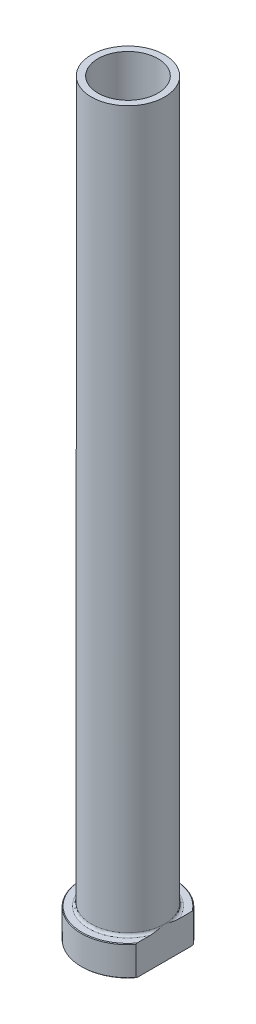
ISO-10303-21;
HEADER;
FILE_DESCRIPTION(('STEP AP214'),'2;1');
FILE_NAME('part.step','',(''),(''),'','','');
FILE_SCHEMA(('AUTOMOTIVE_DESIGN { 1 0 10303 214 1 1 1 1 }'));
ENDSEC;
DATA;
#1=APPLICATION_CONTEXT('core data for automotive mechanical design processes');
#2=APPLICATION_PROTOCOL_DEFINITION('international standard','automotive_design',2000,#1);
#3=PRODUCT_CONTEXT('',#1,'mechanical');
#4=PRODUCT('Part','Part','',(#3));
#5=PRODUCT_RELATED_PRODUCT_CATEGORY('part','',(#4));
#6=PRODUCT_DEFINITION_FORMATION('','',#4);
#7=PRODUCT_DEFINITION_CONTEXT('part definition',#1,'design');
#8=PRODUCT_DEFINITION('design','',#6,#7);
#9=PRODUCT_DEFINITION_SHAPE('','',#8);
#10=(LENGTH_UNIT() NAMED_UNIT(*) SI_UNIT(.MILLI.,.METRE.));
#11=(NAMED_UNIT(*) PLANE_ANGLE_UNIT() SI_UNIT($,.RADIAN.));
#12=(NAMED_UNIT(*) SI_UNIT($,.STERADIAN.) SOLID_ANGLE_UNIT());
#13=UNCERTAINTY_MEASURE_WITH_UNIT(LENGTH_MEASURE(1.E-05),#10,'distance_accuracy_value','');
#14=(GEOMETRIC_REPRESENTATION_CONTEXT(3) GLOBAL_UNCERTAINTY_ASSIGNED_CONTEXT((#13)) GLOBAL_UNIT_ASSIGNED_CONTEXT((#10,
#11,#12)) REPRESENTATION_CONTEXT('',''));
#15=CARTESIAN_POINT('',(0.,0.,0.));
#16=DIRECTION('',(0.,0.,1.));
#17=DIRECTION('',(1.,0.,0.));
#18=AXIS2_PLACEMENT_3D('',#15,#16,#17);
#19=CARTESIAN_POINT('',(0.,92.1876809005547,0.));
#20=DIRECTION('',(0.,1.,0.));
#21=DIRECTION('',(0.,0.,1.));
#22=AXIS2_PLACEMENT_3D('',#19,#20,#21);
#23=CYLINDRICAL_SURFACE('',#22,9.00000000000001);
#24=CARTESIAN_POINT('',(0.,225.,0.));
#25=DIRECTION('',(0.,1.,0.));
#26=DIRECTION('',(0.,0.,1.));
#27=AXIS2_PLACEMENT_3D('',#24,#25,#26);
#28=CIRCLE('',#27,9.00000000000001);
#29=CARTESIAN_POINT('',(0.,225.,9.00000000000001));
#30=VERTEX_POINT('',#29);
#31=EDGE_CURVE('E167',#30,#30,#28,.T.);
#32=ORIENTED_EDGE('',*,*,#31,.T.);
#33=EDGE_LOOP('',(#32));
#34=FACE_BOUND('',#33,.T.);
#35=CARTESIAN_POINT('',(0.,170.,0.));
#36=DIRECTION('',(0.,1.,0.));
#37=DIRECTION('',(0.,0.,1.));
#38=AXIS2_PLACEMENT_3D('',#35,#36,#37);
#39=CIRCLE('',#38,9.00000000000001);
#40=CARTESIAN_POINT('',(0.,170.,9.00000000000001));
#41=VERTEX_POINT('',#40);
#42=EDGE_CURVE('E170',#41,#41,#39,.T.);
#43=ORIENTED_EDGE('',*,*,#42,.F.);
#44=EDGE_LOOP('',(#43));
#45=FACE_BOUND('',#44,.T.);
#46=ADVANCED_FACE('F32',(#34,#45),#23,.F.);
#47=CARTESIAN_POINT('',(-9.00000000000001,225.,0.));
#48=DIRECTION('',(0.,1.,0.));
#49=DIRECTION('',(0.,0.,1.));
#50=AXIS2_PLACEMENT_3D('',#47,#48,#49);
#51=PLANE('',#50);
#52=CARTESIAN_POINT('',(0.,225.,0.));
#53=DIRECTION('',(0.,1.,0.));
#54=DIRECTION('',(0.,0.,1.));
#55=AXIS2_PLACEMENT_3D('',#52,#53,#54);
#56=CIRCLE('',#55,11.);
#57=CARTESIAN_POINT('',(0.,225.,11.));
#58=VERTEX_POINT('',#57);
#59=EDGE_CURVE('E174',#58,#58,#56,.T.);
#60=ORIENTED_EDGE('',*,*,#59,.T.);
#61=EDGE_LOOP('',(#60));
#62=FACE_BOUND('',#61,.T.);
#63=ORIENTED_EDGE('',*,*,#31,.F.);
#64=EDGE_LOOP('',(#63));
#65=FACE_BOUND('',#64,.T.);
#66=ADVANCED_FACE('F157',(#62,#65),#51,.T.);
#67=CARTESIAN_POINT('',(0.,92.1876809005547,0.));
#68=DIRECTION('',(0.,1.,0.));
#69=DIRECTION('',(0.,0.,1.));
#70=AXIS2_PLACEMENT_3D('',#67,#68,#69);
#71=CYLINDRICAL_SURFACE('',#70,11.);
#72=CARTESIAN_POINT('',(0.,9.8,0.));
#73=DIRECTION('',(0.,1.,0.));
#74=DIRECTION('',(0.,0.,1.));
#75=AXIS2_PLACEMENT_3D('',#72,#73,#74);
#76=CIRCLE('',#75,11.);
#77=CARTESIAN_POINT('',(11.,9.8,0.));
#78=VERTEX_POINT('',#77);
#79=EDGE_CURVE('E180',#78,#78,#76,.T.);
#80=ORIENTED_EDGE('',*,*,#79,.T.);
#81=EDGE_LOOP('',(#80));
#82=FACE_BOUND('',#81,.T.);
#83=ORIENTED_EDGE('',*,*,#59,.F.);
#84=EDGE_LOOP('',(#83));
#85=FACE_BOUND('',#84,.T.);
#86=ADVANCED_FACE('F162',(#82,#85),#71,.T.);
#87=CARTESIAN_POINT('',(-11.,9.,0.));
#88=DIRECTION('',(0.,1.,0.));
#89=DIRECTION('',(0.,0.,1.));
#90=AXIS2_PLACEMENT_3D('',#87,#88,#89);
#91=PLANE('',#90);
#92=DIRECTION('',(0.,0.,1.));
#93=VECTOR('',#92,1.);
#94=CARTESIAN_POINT('',(11.,9.,0.));
#95=LINE('',#94,#93);
#96=CARTESIAN_POINT('',(11.,9.,-8.33306666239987));
#97=VERTEX_POINT('',#96);
#98=CARTESIAN_POINT('',(11.,9.,-4.27083130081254));
#99=VERTEX_POINT('',#98);
#100=EDGE_CURVE('E54',#97,#99,#95,.T.);
#101=ORIENTED_EDGE('',*,*,#100,.F.);
#102=CARTESIAN_POINT('',(0.,9.,0.));
#103=DIRECTION('',(0.,1.,0.));
#104=DIRECTION('',(0.,0.,1.));
#105=AXIS2_PLACEMENT_3D('',#102,#103,#104);
#106=CIRCLE('',#105,13.8);
#107=CARTESIAN_POINT('',(11.,9.,8.33306666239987));
#108=VERTEX_POINT('',#107);
#109=EDGE_CURVE('E186',#97,#108,#106,.T.);
#110=ORIENTED_EDGE('',*,*,#109,.T.);
#111=CARTESIAN_POINT('',(11.,9.,4.27083130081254));
#112=VERTEX_POINT('',#111);
#113=EDGE_CURVE('E134',#112,#108,#95,.T.);
#114=ORIENTED_EDGE('',*,*,#113,.F.);
#115=CARTESIAN_POINT('',(0.,9.,0.));
#116=DIRECTION('',(0.,1.,0.));
#117=DIRECTION('',(0.,0.,1.));
#118=AXIS2_PLACEMENT_3D('',#115,#116,#117);
#119=CIRCLE('',#118,11.8);
#120=EDGE_CURVE('E183',#112,#99,#119,.F.);
#121=ORIENTED_EDGE('',*,*,#120,.T.);
#122=EDGE_LOOP('',(#101,#110,#114,#121));
#123=FACE_BOUND('',#122,.T.);
#124=ADVANCED_FACE('F197',(#123),#91,.T.);
#125=CARTESIAN_POINT('',(0.,92.1876809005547,0.));
#126=DIRECTION('',(0.,1.,0.));
#127=DIRECTION('',(0.,0.,1.));
#128=AXIS2_PLACEMENT_3D('',#125,#126,#127);
#129=CYLINDRICAL_SURFACE('',#128,14.);
#130=DIRECTION('',(0.,-1.,0.));
#131=VECTOR('',#130,1.);
#132=CARTESIAN_POINT('',(11.,225.,8.66025403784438));
#133=LINE('',#132,#131);
#134=CARTESIAN_POINT('',(11.,8.8,8.66025403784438));
#135=VERTEX_POINT('',#134);
#136=CARTESIAN_POINT('',(11.,0.199999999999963,8.66025403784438));
#137=VERTEX_POINT('',#136);
#138=EDGE_CURVE('E82',#135,#137,#133,.T.);
#139=ORIENTED_EDGE('',*,*,#138,.F.);
#140=CARTESIAN_POINT('',(0.,8.8,0.));
#141=DIRECTION('',(0.,1.,0.));
#142=DIRECTION('',(0.,0.,1.));
#143=AXIS2_PLACEMENT_3D('',#140,#141,#142);
#144=CIRCLE('',#143,14.);
#145=CARTESIAN_POINT('',(11.,8.8,-8.66025403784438));
#146=VERTEX_POINT('',#145);
#147=EDGE_CURVE('E95',#135,#146,#144,.F.);
#148=ORIENTED_EDGE('',*,*,#147,.T.);
#149=DIRECTION('',(0.,-1.,0.));
#150=VECTOR('',#149,1.);
#151=CARTESIAN_POINT('',(11.,225.,-8.66025403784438));
#152=LINE('',#151,#150);
#153=CARTESIAN_POINT('',(11.,0.199999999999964,-8.66025403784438));
#154=VERTEX_POINT('',#153);
#155=EDGE_CURVE('E192',#146,#154,#152,.T.);
#156=ORIENTED_EDGE('',*,*,#155,.T.);
#157=CARTESIAN_POINT('',(0.,0.199999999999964,0.));
#158=DIRECTION('',(0.,-1.,0.));
#159=DIRECTION('',(0.,0.,-1.));
#160=AXIS2_PLACEMENT_3D('',#157,#158,#159);
#161=CIRCLE('',#160,14.);
#162=EDGE_CURVE('E98',#154,#137,#161,.F.);
#163=ORIENTED_EDGE('',*,*,#162,.T.);
#164=EDGE_LOOP('',(#139,#148,#156,#163));
#165=FACE_BOUND('',#164,.T.);
#166=ADVANCED_FACE('F190',(#165),#129,.T.);
#167=CARTESIAN_POINT('',(-14.,0.,0.));
#168=DIRECTION('',(0.,-1.,0.));
#169=DIRECTION('',(0.,0.,-1.));
#170=AXIS2_PLACEMENT_3D('',#167,#168,#169);
#171=PLANE('',#170);
#172=CARTESIAN_POINT('',(0.,0.,0.));
#173=DIRECTION('',(0.,-1.,0.));
#174=DIRECTION('',(0.,0.,-1.));
#175=AXIS2_PLACEMENT_3D('',#172,#173,#174);
#176=CIRCLE('',#175,9.74999999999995);
#177=CARTESIAN_POINT('',(0.,0.,-9.74999999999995));
#178=VERTEX_POINT('',#177);
#179=EDGE_CURVE('E40',#178,#178,#176,.F.);
#180=ORIENTED_EDGE('',*,*,#179,.T.);
#181=EDGE_LOOP('',(#180));
#182=FACE_BOUND('',#181,.T.);
#183=DIRECTION('',(0.,0.,-1.));
#184=VECTOR('',#183,1.);
#185=CARTESIAN_POINT('',(11.,0.,8.66025403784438));
#186=LINE('',#185,#184);
#187=CARTESIAN_POINT('',(11.,0.,8.33306666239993));
#188=VERTEX_POINT('',#187);
#189=CARTESIAN_POINT('',(11.,0.,-8.33306666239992));
#190=VERTEX_POINT('',#189);
#191=EDGE_CURVE('E47',#188,#190,#186,.T.);
#192=ORIENTED_EDGE('',*,*,#191,.F.);
#193=CARTESIAN_POINT('',(0.,0.,0.));
#194=DIRECTION('',(0.,-1.,0.));
#195=DIRECTION('',(0.,0.,-1.));
#196=AXIS2_PLACEMENT_3D('',#193,#194,#195);
#197=CIRCLE('',#196,13.8);
#198=EDGE_CURVE('E92',#188,#190,#197,.T.);
#199=ORIENTED_EDGE('',*,*,#198,.T.);
#200=EDGE_LOOP('',(#192,#199));
#201=FACE_BOUND('',#200,.T.);
#202=ADVANCED_FACE('F91',(#182,#201),#171,.T.);
#203=CARTESIAN_POINT('',(0.,92.1876809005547,0.));
#204=DIRECTION('',(0.,1.,0.));
#205=DIRECTION('',(0.,0.,1.));
#206=AXIS2_PLACEMENT_3D('',#203,#204,#205);
#207=CYLINDRICAL_SURFACE('',#206,9.25);
#208=CARTESIAN_POINT('',(0.,0.499999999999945,0.));
#209=DIRECTION('',(0.,-1.,0.));
#210=DIRECTION('',(0.,0.,-1.));
#211=AXIS2_PLACEMENT_3D('',#208,#209,#210);
#212=CIRCLE('',#211,9.25);
#213=CARTESIAN_POINT('',(0.,0.499999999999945,-9.25));
#214=VERTEX_POINT('',#213);
#215=EDGE_CURVE('E11',#214,#214,#212,.T.);
#216=ORIENTED_EDGE('',*,*,#215,.T.);
#217=EDGE_LOOP('',(#216));
#218=FACE_BOUND('',#217,.T.);
#219=CARTESIAN_POINT('',(0.,158.,0.));
#220=DIRECTION('',(0.,1.,0.));
#221=DIRECTION('',(0.,0.,1.));
#222=AXIS2_PLACEMENT_3D('',#219,#220,#221);
#223=CIRCLE('',#222,9.25000000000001);
#224=CARTESIAN_POINT('',(0.,158.,9.25000000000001));
#225=VERTEX_POINT('',#224);
#226=EDGE_CURVE('E172',#225,#225,#223,.T.);
#227=ORIENTED_EDGE('',*,*,#226,.T.);
#228=EDGE_LOOP('',(#227));
#229=FACE_BOUND('',#228,.T.);
#230=ADVANCED_FACE('F215',(#218,#229),#207,.F.);
#231=CARTESIAN_POINT('',(0.,158.,0.));
#232=DIRECTION('',(0.,-1.,0.));
#233=DIRECTION('',(0.,0.,-1.));
#234=AXIS2_PLACEMENT_3D('',#231,#232,#233);
#235=CONICAL_SURFACE('',#234,9.25000000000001,0.0208303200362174);
#236=ORIENTED_EDGE('',*,*,#42,.T.);
#237=EDGE_LOOP('',(#236));
#238=FACE_BOUND('',#237,.T.);
#239=ORIENTED_EDGE('',*,*,#226,.F.);
#240=EDGE_LOOP('',(#239));
#241=FACE_BOUND('',#240,.T.);
#242=ADVANCED_FACE('F111',(#238,#241),#235,.F.);
#243=CARTESIAN_POINT('',(0.,9.8,0.));
#244=DIRECTION('',(0.,1.,0.));
#245=DIRECTION('',(0.,0.,1.));
#246=AXIS2_PLACEMENT_3D('',#243,#244,#245);
#247=TOROIDAL_SURFACE('',#246,11.8,0.8);
#248=ORIENTED_EDGE('',*,*,#120,.F.);
#249=CARTESIAN_POINT('',(11.,9.8,0.));
#250=CARTESIAN_POINT('',(11.,9.80000101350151,-1.16901612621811E-10));
#251=CARTESIAN_POINT('',(11.,9.80000202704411,3.62636660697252E-07));
#252=CARTESIAN_POINT('',(11.,9.80000392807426,1.38767048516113E-06));
#253=CARTESIAN_POINT('',(11.,9.80000479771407,2.07263783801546E-06));
#254=CARTESIAN_POINT('',(11.,9.8000065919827,3.71036690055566E-06));
#255=CARTESIAN_POINT('',(11.,9.80000749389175,4.68930230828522E-06));
#256=CARTESIAN_POINT('',(11.,9.80000912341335,6.73011595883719E-06));
#257=CARTESIAN_POINT('',(11.,9.80000985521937,7.78888170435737E-06));
#258=CARTESIAN_POINT('',(11.,9.80001253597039,1.18457658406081E-05));
#259=CARTESIAN_POINT('',(11.,9.80001433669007,1.49465073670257E-05));
#260=CARTESIAN_POINT('',(11.,9.80001733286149,2.11226762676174E-05));
#261=CARTESIAN_POINT('',(11.,9.80001856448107,2.41813364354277E-05));
#262=CARTESIAN_POINT('',(11.,9.80002366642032,3.70013760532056E-05));
#263=CARTESIAN_POINT('',(11.,9.80002742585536,4.68141722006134E-05));
#264=CARTESIAN_POINT('',(11.,9.80003302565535,6.54425681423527E-05));
#265=CARTESIAN_POINT('',(11.,9.80003506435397,7.41984101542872E-05));
#266=CARTESIAN_POINT('',(11.,9.80004981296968,0.000138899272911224));
#267=CARTESIAN_POINT('',(11.,9.80006088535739,0.000195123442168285));
#268=CARTESIAN_POINT('',(11.,9.80010935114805,0.000417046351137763));
#269=CARTESIAN_POINT('',(11.,9.80015570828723,0.000580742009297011));
#270=CARTESIAN_POINT('',(11.,9.8003360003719,0.00122860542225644));
#271=CARTESIAN_POINT('',(11.,9.80046404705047,0.0017139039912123));
#272=CARTESIAN_POINT('',(11.,9.80097655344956,0.00364143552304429));
#273=CARTESIAN_POINT('',(11.,9.80136837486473,0.0050822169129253));
#274=CARTESIAN_POINT('',(11.,9.80300002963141,0.0110983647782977));
#275=CARTESIAN_POINT('',(11.,9.80423069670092,0.0156755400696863));
#276=CARTESIAN_POINT('',(10.9999999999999,9.82474721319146,0.0919599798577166));
#277=CARTESIAN_POINT('',(11.,9.84411511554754,0.163651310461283));
#278=CARTESIAN_POINT('',(11.,9.8819343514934,0.304144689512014));
#279=CARTESIAN_POINT('',(11.,9.90039088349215,0.372945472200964));
#280=CARTESIAN_POINT('',(11.,9.93953155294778,0.519420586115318));
#281=CARTESIAN_POINT('',(11.,9.96019740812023,0.597099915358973));
#282=CARTESIAN_POINT('',(11.,10.0014716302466,0.753402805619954));
#283=CARTESIAN_POINT('',(11.,10.02207677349,0.832027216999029));
#284=CARTESIAN_POINT('',(11.,10.0569012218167,0.966276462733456));
#285=CARTESIAN_POINT('',(11.,10.0712190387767,1.02187571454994));
#286=CARTESIAN_POINT('',(11.,10.0995828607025,1.13298938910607));
#287=CARTESIAN_POINT('',(11.,10.1136294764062,1.18850365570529));
#288=CARTESIAN_POINT('',(11.,10.1546367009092,1.35225812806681));
#289=CARTESIAN_POINT('',(11.,10.1812165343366,1.4605935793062));
#290=CARTESIAN_POINT('',(11.,10.2669117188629,1.81933910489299));
#291=CARTESIAN_POINT('',(11.,10.3231642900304,2.07044657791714));
#292=CARTESIAN_POINT('',(11.,10.4250125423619,2.57779828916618));
#293=CARTESIAN_POINT('',(11.,10.4704839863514,2.83406864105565));
#294=CARTESIAN_POINT('',(11.,10.5272211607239,3.23096220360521));
#295=CARTESIAN_POINT('',(11.,10.5446090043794,3.37070252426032));
#296=CARTESIAN_POINT('',(11.,10.5730475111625,3.65081430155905));
#297=CARTESIAN_POINT('',(11.,10.5840998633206,3.79118557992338));
#298=CARTESIAN_POINT('',(11.,10.5982304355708,4.07161741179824));
#299=CARTESIAN_POINT('',(11.,10.6013499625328,4.21167576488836));
#300=CARTESIAN_POINT('',(11.,10.5975625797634,4.49161919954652));
#301=CARTESIAN_POINT('',(11.,10.5906655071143,4.63150431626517));
#302=CARTESIAN_POINT('',(11.,10.5704363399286,4.83931097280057));
#303=CARTESIAN_POINT('',(11.,10.562146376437,4.90772588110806));
#304=CARTESIAN_POINT('',(11.,10.5417448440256,5.04405523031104));
#305=CARTESIAN_POINT('',(11.,10.5296301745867,5.11196921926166));
#306=CARTESIAN_POINT('',(11.,10.5009997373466,5.24610291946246));
#307=CARTESIAN_POINT('',(11.,10.4845340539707,5.31233305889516));
#308=CARTESIAN_POINT('',(11.,10.4461783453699,5.44314716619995));
#309=CARTESIAN_POINT('',(11.,10.4242944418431,5.50773290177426));
#310=CARTESIAN_POINT('',(11.,10.373421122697,5.63494480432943));
#311=CARTESIAN_POINT('',(11.,10.3443615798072,5.69754429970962));
#312=CARTESIAN_POINT('',(11.,10.2940125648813,5.78758577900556));
#313=CARTESIAN_POINT('',(11.,10.2761248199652,5.81692841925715));
#314=CARTESIAN_POINT('',(11.,10.2377448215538,5.8738430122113));
#315=CARTESIAN_POINT('',(11.,10.2172553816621,5.90141683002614));
#316=CARTESIAN_POINT('',(11.,10.1754926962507,5.95144540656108));
#317=CARTESIAN_POINT('',(11.,10.1545053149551,5.97413611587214));
#318=CARTESIAN_POINT('',(11.,10.1098178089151,6.01675330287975));
#319=CARTESIAN_POINT('',(11.,10.0861159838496,6.03667803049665));
#320=CARTESIAN_POINT('',(11.,10.0355211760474,6.07288913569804));
#321=CARTESIAN_POINT('',(11.,10.0085887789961,6.08912169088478));
#322=CARTESIAN_POINT('',(11.,9.95208821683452,6.11604527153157));
#323=CARTESIAN_POINT('',(11.,9.92252876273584,6.1267538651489));
#324=CARTESIAN_POINT('',(11.,9.87044933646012,6.13915978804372));
#325=CARTESIAN_POINT('',(11.,9.84833164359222,6.14255775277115));
#326=CARTESIAN_POINT('',(11.,9.80383923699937,6.1455308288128));
#327=CARTESIAN_POINT('',(11.,9.78146463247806,6.14510750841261));
#328=CARTESIAN_POINT('',(11.,9.73715415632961,6.14047859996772));
#329=CARTESIAN_POINT('',(11.,9.71521765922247,6.13627886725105));
#330=CARTESIAN_POINT('',(11.,9.67228934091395,6.12446633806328));
#331=CARTESIAN_POINT('',(11.,9.65129820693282,6.1168511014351));
#332=CARTESIAN_POINT('',(11.,9.60293880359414,6.09531376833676));
#333=CARTESIAN_POINT('',(11.,9.57614979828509,6.08009633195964));
#334=CARTESIAN_POINT('',(11.,9.52533680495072,6.04559207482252));
#335=CARTESIAN_POINT('',(11.,9.50131971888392,6.02629542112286));
#336=CARTESIAN_POINT('',(11.,9.44252607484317,5.97248581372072));
#337=CARTESIAN_POINT('',(11.,9.4098152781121,5.9357354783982));
#338=CARTESIAN_POINT('',(11.,9.35019076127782,5.85789950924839));
#339=CARTESIAN_POINT('',(11.,9.32328591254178,5.81680738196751));
#340=CARTESIAN_POINT('',(11.,9.27531247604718,5.73382009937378));
#341=CARTESIAN_POINT('',(11.,9.25403723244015,5.69204233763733));
#342=CARTESIAN_POINT('',(11.,9.21507165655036,5.60682590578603));
#343=CARTESIAN_POINT('',(11.,9.19738479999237,5.56338567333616));
#344=CARTESIAN_POINT('',(11.,9.16492416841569,5.47505507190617));
#345=CARTESIAN_POINT('',(11.,9.15017444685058,5.43015597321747));
#346=CARTESIAN_POINT('',(11.,9.12332484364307,5.33960740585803));
#347=CARTESIAN_POINT('',(11.,9.11122363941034,5.29395832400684));
#348=CARTESIAN_POINT('',(11.,9.08512909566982,5.18461425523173));
#349=CARTESIAN_POINT('',(11.,9.0721724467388,5.12067246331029));
#350=CARTESIAN_POINT('',(11.,9.04991113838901,4.99214785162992));
#351=CARTESIAN_POINT('',(11.,9.04060805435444,4.92756476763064));
#352=CARTESIAN_POINT('',(11.,9.01731839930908,4.7329421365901));
#353=CARTESIAN_POINT('',(11.,9.00801869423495,4.60233754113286));
#354=CARTESIAN_POINT('',(11.,8.99902947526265,4.34550193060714));
#355=CARTESIAN_POINT('',(11.,8.99901276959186,4.2192790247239));
#356=CARTESIAN_POINT('',(11.,9.00595929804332,3.96771196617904));
#357=CARTESIAN_POINT('',(11.,9.01288556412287,3.8423667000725));
#358=CARTESIAN_POINT('',(11.,9.03307410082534,3.58284783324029));
#359=CARTESIAN_POINT('',(11.,9.04676832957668,3.44870920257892));
#360=CARTESIAN_POINT('',(11.,9.07939011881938,3.18114709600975));
#361=CARTESIAN_POINT('',(11.,9.09831526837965,3.04772331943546));
#362=CARTESIAN_POINT('',(11.,9.1409202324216,2.77842123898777));
#363=CARTESIAN_POINT('',(11.,9.16470161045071,2.64255921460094));
#364=CARTESIAN_POINT('',(11.,9.21593088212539,2.37116504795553));
#365=CARTESIAN_POINT('',(11.,9.24338827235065,2.23563471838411));
#366=CARTESIAN_POINT('',(11.,9.31183649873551,1.91532204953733));
#367=CARTESIAN_POINT('',(11.,9.35408384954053,1.73080986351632));
#368=CARTESIAN_POINT('',(11.,9.44184141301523,1.36477440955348));
#369=CARTESIAN_POINT('',(11.,9.48730948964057,1.18324089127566));
#370=CARTESIAN_POINT('',(11.,9.5545245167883,0.921934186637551));
#371=CARTESIAN_POINT('',(11.,9.57534575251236,0.841920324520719));
#372=CARTESIAN_POINT('',(11.,9.61742284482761,0.681633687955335));
#373=CARTESIAN_POINT('',(11.,9.63868020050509,0.60136130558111));
#374=CARTESIAN_POINT('',(11.,9.68246779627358,0.436916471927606));
#375=CARTESIAN_POINT('',(11.,9.7050090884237,0.352747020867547));
#376=CARTESIAN_POINT('',(11.,9.74991333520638,0.185809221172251));
#377=CARTESIAN_POINT('',(10.9999999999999,9.77227331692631,0.103040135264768));
#378=CARTESIAN_POINT('',(11.,9.79577053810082,0.0156708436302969));
#379=CARTESIAN_POINT('',(11.,9.79700248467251,0.0110889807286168));
#380=CARTESIAN_POINT('',(11.,9.79863444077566,0.00507176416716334));
#381=CARTESIAN_POINT('',(11.,9.79902527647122,0.00363459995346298));
#382=CARTESIAN_POINT('',(11.,9.79953658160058,0.00171158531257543));
#383=CARTESIAN_POINT('',(11.,9.79966439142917,0.00122718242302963));
#384=CARTESIAN_POINT('',(11.,9.79984439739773,0.000580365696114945));
#385=CARTESIAN_POINT('',(11.,9.79989071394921,0.000416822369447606));
#386=CARTESIAN_POINT('',(11.,9.79993914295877,0.000195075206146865));
#387=CARTESIAN_POINT('',(11.,9.79995021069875,0.000138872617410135));
#388=CARTESIAN_POINT('',(11.,9.79996494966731,7.4193722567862E-05));
#389=CARTESIAN_POINT('',(11.,9.79996698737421,6.54390990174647E-05));
#390=CARTESIAN_POINT('',(11.,9.79997258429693,4.6813183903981E-05));
#391=CARTESIAN_POINT('',(11.,9.79997634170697,3.70015854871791E-05));
#392=CARTESIAN_POINT('',(11.,9.79998144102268,2.4182781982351E-05));
#393=CARTESIAN_POINT('',(11.,9.79998267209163,2.11242130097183E-05));
#394=CARTESIAN_POINT('',(11.,9.79998566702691,1.49481341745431E-05));
#395=CARTESIAN_POINT('',(11.,9.79998746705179,1.18473804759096E-05));
#396=CARTESIAN_POINT('',(11.,9.79999014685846,7.79037207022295E-06));
#397=CARTESIAN_POINT('',(11.,9.79999087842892,6.73154418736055E-06));
#398=CARTESIAN_POINT('',(11.,9.79999250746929,4.69056374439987E-06));
#399=CARTESIAN_POINT('',(11.,9.79999340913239,3.71152227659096E-06));
#400=CARTESIAN_POINT('',(11.,9.79999520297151,2.07354313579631E-06));
#401=CARTESIAN_POINT('',(11.,9.79999607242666,1.38844083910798E-06));
#402=CARTESIAN_POINT('',(11.,9.79999797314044,3.6306761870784E-07));
#403=CARTESIAN_POINT('',(11.,9.79999898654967,1.16900116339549E-10));
#404=CARTESIAN_POINT('',(11.,9.8,0.));
#405=B_SPLINE_CURVE_WITH_KNOTS('',3,(#249,#250,#251,#252,#253,#254,#255,#256,#257,#258,#259,
#260,#261,#262,#263,#264,#265,#266,#267,#268,#269,#270,#271,#272,#273,#274,#275,#276,#277,#278,
#279,#280,#281,#282,#283,#284,#285,#286,#287,#288,#289,#290,#291,#292,#293,#294,#295,#296,#297,
#298,#299,#300,#301,#302,#303,#304,#305,#306,#307,#308,#309,#310,#311,#312,#313,#314,#315,#316,
#317,#318,#319,#320,#321,#322,#323,#324,#325,#326,#327,#328,#329,#330,#331,#332,#333,#334,#335,
#336,#337,#338,#339,#340,#341,#342,#343,#344,#345,#346,#347,#348,#349,#350,#351,#352,#353,#354,
#355,#356,#357,#358,#359,#360,#361,#362,#363,#364,#365,#366,#367,#368,#369,#370,#371,#372,#373,
#374,#375,#376,#377,#378,#379,#380,#381,#382,#383,#384,#385,#386,#387,#388,#389,#390,#391,#392,
#393,#394,#395,#396,#397,#398,#399,#400,#401,#402,#403,#404),.UNSPECIFIED.,.T.,.F.,(4,2,2,2,2,2,
2,2,2,2,2,2,2,2,2,2,2,2,2,2,2,2,2,2,2,2,2,2,2,2,2,2,2,2,2,2,2,2,2,2,2,2,2,2,2,2,2,2,2,2,2,2,2,2,
2,2,2,2,2,2,2,2,2,2,2,2,2,2,2,2,2,2,2,2,2,2,2,4),(0.,3.06076050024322E-06,6.37973438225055E-06,
1.03502655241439E-05,1.42089708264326E-05,2.49252539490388E-05,3.4808552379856E-05,
6.62739362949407E-05,9.32104405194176E-05,0.000265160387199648,0.000775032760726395,
0.00228129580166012,0.00675996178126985,0.0209798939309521,0.243756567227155,0.457458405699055,
0.698601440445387,0.942439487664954,1.11467870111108,1.28646938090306,1.621111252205,
2.39296447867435,3.17332138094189,3.59566656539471,4.01789910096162,4.43792849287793,
4.85754566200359,5.06420795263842,5.2710382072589,5.4755841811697,5.67990009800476,
5.88629782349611,5.98928489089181,6.09216151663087,6.18469603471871,6.27728883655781,
6.37115541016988,6.46472158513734,6.53154940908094,6.59834980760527,6.66504681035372,
6.73179153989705,6.8236989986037,6.91583057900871,7.06259901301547,7.20959014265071,
7.35003074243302,7.49060673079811,7.63229046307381,7.77390328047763,7.9694893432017,
8.16515964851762,8.55744262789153,8.93589815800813,9.31234923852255,9.71673016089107,
10.1209250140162,10.5346477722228,10.9494607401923,11.5172595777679,12.07865964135,
12.3266950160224,12.5758117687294,12.8372206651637,13.0944202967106,13.1086548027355,
13.1131222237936,13.1146257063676,13.1151351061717,13.1153069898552,13.1153339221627,
13.1153653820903,13.1153752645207,13.115385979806,13.1153898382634,13.1153938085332,
13.1153971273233,13.1154001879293),.UNSPECIFIED.);
#406=EDGE_CURVE('E126',#112,#78,#405,.T.);
#407=ORIENTED_EDGE('',*,*,#406,.T.);
#408=ORIENTED_EDGE('',*,*,#79,.F.);
#409=CARTESIAN_POINT('',(11.,9.8,0.));
#410=CARTESIAN_POINT('',(11.,9.7999989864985,1.16905993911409E-10));
#411=CARTESIAN_POINT('',(11.,9.7999979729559,-3.62636656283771E-07));
#412=CARTESIAN_POINT('',(11.,9.79999607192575,-1.3876704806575E-06));
#413=CARTESIAN_POINT('',(11.,9.79999520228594,-2.07263783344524E-06));
#414=CARTESIAN_POINT('',(11.,9.7999934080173,-3.71036689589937E-06));
#415=CARTESIAN_POINT('',(11.,9.79999250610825,-4.68930230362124E-06));
#416=CARTESIAN_POINT('',(11.,9.79999087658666,-6.73011595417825E-06));
#417=CARTESIAN_POINT('',(11.,9.79999014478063,-7.78888169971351E-06));
#418=CARTESIAN_POINT('',(11.,9.79998746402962,-1.18457658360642E-05));
#419=CARTESIAN_POINT('',(11.,9.79998566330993,-1.49465073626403E-05));
#420=CARTESIAN_POINT('',(11.,9.79998266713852,-2.1122676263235E-05));
#421=CARTESIAN_POINT('',(11.,9.79998143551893,-2.41813364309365E-05));
#422=CARTESIAN_POINT('',(11.,9.79997633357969,-3.70013760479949E-05));
#423=CARTESIAN_POINT('',(11.,9.79997257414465,-4.68141721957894E-05));
#424=CARTESIAN_POINT('',(11.,9.79996697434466,-6.54425681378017E-05));
#425=CARTESIAN_POINT('',(11.,9.79996493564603,-7.4198410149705E-05));
#426=CARTESIAN_POINT('',(11.,9.79995018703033,-0.000138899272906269));
#427=CARTESIAN_POINT('',(11.,9.79993911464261,-0.000195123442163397));
#428=CARTESIAN_POINT('',(11.,9.79989064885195,-0.00041704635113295));
#429=CARTESIAN_POINT('',(11.,9.79984429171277,-0.000580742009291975));
#430=CARTESIAN_POINT('',(11.,9.7996639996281,-0.00122860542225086));
#431=CARTESIAN_POINT('',(11.,9.79953595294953,-0.0017139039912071));
#432=CARTESIAN_POINT('',(11.,9.79902344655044,-0.00364143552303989));
#433=CARTESIAN_POINT('',(11.,9.79863162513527,-0.005082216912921));
#434=CARTESIAN_POINT('',(11.,9.7969999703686,-0.011098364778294));
#435=CARTESIAN_POINT('',(11.,9.79576930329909,-0.0156755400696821));
#436=CARTESIAN_POINT('',(10.9999999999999,9.77525278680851,-0.0919599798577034));
#437=CARTESIAN_POINT('',(11.,9.75588488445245,-0.163651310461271));
#438=CARTESIAN_POINT('',(11.,9.71806564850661,-0.304144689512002));
#439=CARTESIAN_POINT('',(11.,9.69960911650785,-0.37294547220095));
#440=CARTESIAN_POINT('',(11.,9.66046844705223,-0.519420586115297));
#441=CARTESIAN_POINT('',(11.,9.63980259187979,-0.597099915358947));
#442=CARTESIAN_POINT('',(11.,9.59852836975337,-0.753402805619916));
#443=CARTESIAN_POINT('',(11.,9.57792322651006,-0.832027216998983));
#444=CARTESIAN_POINT('',(11.,9.54309877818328,-0.966276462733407));
#445=CARTESIAN_POINT('',(11.,9.52878096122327,-1.0218757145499));
#446=CARTESIAN_POINT('',(11.,9.50041713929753,-1.13298938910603));
#447=CARTESIAN_POINT('',(11.,9.4863705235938,-1.18850365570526));
#448=CARTESIAN_POINT('',(11.,9.4453632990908,-1.35225812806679));
#449=CARTESIAN_POINT('',(11.,9.41878346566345,-1.46059357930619));
#450=CARTESIAN_POINT('',(11.,9.33308828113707,-1.81933910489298));
#451=CARTESIAN_POINT('',(11.,9.27683570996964,-2.07044657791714));
#452=CARTESIAN_POINT('',(11.,9.17498745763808,-2.57779828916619));
#453=CARTESIAN_POINT('',(11.,9.12951601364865,-2.83406864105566));
#454=CARTESIAN_POINT('',(11.,9.07277883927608,-3.23096220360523));
#455=CARTESIAN_POINT('',(11.,9.05539099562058,-3.37070252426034));
#456=CARTESIAN_POINT('',(11.,9.0269524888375,-3.65081430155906));
#457=CARTESIAN_POINT('',(11.,9.01590013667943,-3.79118557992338));
#458=CARTESIAN_POINT('',(11.,9.00176956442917,-4.07161741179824));
#459=CARTESIAN_POINT('',(11.,8.99865003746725,-4.21167576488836));
#460=CARTESIAN_POINT('',(11.,9.00243742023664,-4.49161919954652));
#461=CARTESIAN_POINT('',(11.,9.0093344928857,-4.63150431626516));
#462=CARTESIAN_POINT('',(11.,9.02956366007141,-4.83931097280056));
#463=CARTESIAN_POINT('',(11.,9.03785362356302,-4.90772588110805));
#464=CARTESIAN_POINT('',(11.,9.05825515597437,-5.04405523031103));
#465=CARTESIAN_POINT('',(11.,9.0703698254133,-5.11196921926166));
#466=CARTESIAN_POINT('',(11.,9.09900026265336,-5.24610291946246));
#467=CARTESIAN_POINT('',(11.,9.11546594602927,-5.31233305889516));
#468=CARTESIAN_POINT('',(11.,9.15382165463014,-5.44314716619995));
#469=CARTESIAN_POINT('',(11.,9.17570555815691,-5.50773290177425));
#470=CARTESIAN_POINT('',(11.,9.226578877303,-5.63494480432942));
#471=CARTESIAN_POINT('',(11.,9.25563842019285,-5.69754429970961));
#472=CARTESIAN_POINT('',(11.,9.30598743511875,-5.78758577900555));
#473=CARTESIAN_POINT('',(11.,9.32387518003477,-5.81692841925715));
#474=CARTESIAN_POINT('',(11.,9.36225517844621,-5.87384301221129));
#475=CARTESIAN_POINT('',(11.,9.38274461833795,-5.90141683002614));
#476=CARTESIAN_POINT('',(11.,9.42450730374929,-5.95144540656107));
#477=CARTESIAN_POINT('',(11.,9.44549468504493,-5.97413611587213));
#478=CARTESIAN_POINT('',(11.,9.49018219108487,-6.01675330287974));
#479=CARTESIAN_POINT('',(11.,9.51388401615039,-6.03667803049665));
#480=CARTESIAN_POINT('',(11.,9.56447882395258,-6.07288913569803));
#481=CARTESIAN_POINT('',(11.,9.59141122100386,-6.08912169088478));
#482=CARTESIAN_POINT('',(11.,9.64791178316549,-6.11604527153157));
#483=CARTESIAN_POINT('',(11.,9.67747123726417,-6.12675386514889));
#484=CARTESIAN_POINT('',(11.,9.72955066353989,-6.13915978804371));
#485=CARTESIAN_POINT('',(11.,9.7516683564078,-6.14255775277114));
#486=CARTESIAN_POINT('',(11.,9.79616076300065,-6.14553082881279));
#487=CARTESIAN_POINT('',(11.,9.81853536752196,-6.1451075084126));
#488=CARTESIAN_POINT('',(11.,9.86284584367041,-6.14047859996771));
#489=CARTESIAN_POINT('',(11.,9.88478234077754,-6.13627886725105));
#490=CARTESIAN_POINT('',(11.,9.92771065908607,-6.12446633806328));
#491=CARTESIAN_POINT('',(11.,9.94870179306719,-6.11685110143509));
#492=CARTESIAN_POINT('',(11.,9.99706119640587,-6.09531376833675));
#493=CARTESIAN_POINT('',(11.,10.0238502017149,-6.08009633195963));
#494=CARTESIAN_POINT('',(11.,10.0746631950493,-6.04559207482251));
#495=CARTESIAN_POINT('',(11.,10.0986802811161,-6.02629542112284));
#496=CARTESIAN_POINT('',(11.,10.1574739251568,-5.9724858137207));
#497=CARTESIAN_POINT('',(11.,10.1901847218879,-5.93573547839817));
#498=CARTESIAN_POINT('',(11.,10.2498092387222,-5.85789950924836));
#499=CARTESIAN_POINT('',(11.,10.2767140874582,-5.81680738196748));
#500=CARTESIAN_POINT('',(11.,10.3246875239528,-5.73382009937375));
#501=CARTESIAN_POINT('',(11.,10.3459627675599,-5.69204233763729));
#502=CARTESIAN_POINT('',(11.,10.3849283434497,-5.60682590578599));
#503=CARTESIAN_POINT('',(11.,10.4026152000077,-5.56338567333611));
#504=CARTESIAN_POINT('',(11.,10.4350758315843,-5.47505507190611));
#505=CARTESIAN_POINT('',(11.,10.4498255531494,-5.43015597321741));
#506=CARTESIAN_POINT('',(11.,10.476675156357,-5.33960740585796));
#507=CARTESIAN_POINT('',(11.,10.4887763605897,-5.29395832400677));
#508=CARTESIAN_POINT('',(11.,10.5148709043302,-5.18461425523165));
#509=CARTESIAN_POINT('',(11.,10.5278275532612,-5.12067246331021));
#510=CARTESIAN_POINT('',(11.,10.550088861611,-4.99214785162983));
#511=CARTESIAN_POINT('',(11.,10.5593919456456,-4.92756476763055));
#512=CARTESIAN_POINT('',(11.,10.5826816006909,-4.73294213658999));
#513=CARTESIAN_POINT('',(11.,10.5919813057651,-4.60233754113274));
#514=CARTESIAN_POINT('',(11.,10.6009705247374,-4.34550193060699));
#515=CARTESIAN_POINT('',(11.,10.6009872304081,-4.21927902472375));
#516=CARTESIAN_POINT('',(11.,10.5940407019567,-3.96771196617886));
#517=CARTESIAN_POINT('',(11.,10.5871144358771,-3.8423667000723));
#518=CARTESIAN_POINT('',(11.,10.5669258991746,-3.5828478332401));
#519=CARTESIAN_POINT('',(11.,10.5532316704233,-3.44870920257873));
#520=CARTESIAN_POINT('',(11.,10.5206098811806,-3.18114709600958));
#521=CARTESIAN_POINT('',(11.,10.5016847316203,-3.0477233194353));
#522=CARTESIAN_POINT('',(11.,10.4590797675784,-2.77842123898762));
#523=CARTESIAN_POINT('',(11.,10.4352983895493,-2.64255921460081));
#524=CARTESIAN_POINT('',(11.,10.3840691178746,-2.37116504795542));
#525=CARTESIAN_POINT('',(11.,10.3566117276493,-2.23563471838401));
#526=CARTESIAN_POINT('',(11.,10.2881635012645,-1.91532204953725));
#527=CARTESIAN_POINT('',(11.,10.2459161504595,-1.73080986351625));
#528=CARTESIAN_POINT('',(11.,10.1581585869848,-1.36477440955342));
#529=CARTESIAN_POINT('',(11.,10.1126905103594,-1.18324089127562));
#530=CARTESIAN_POINT('',(11.,10.0454754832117,-0.921934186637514));
#531=CARTESIAN_POINT('',(11.,10.0246542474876,-0.841920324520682));
#532=CARTESIAN_POINT('',(11.,9.98257715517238,-0.6816336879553));
#533=CARTESIAN_POINT('',(11.,9.9613197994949,-0.601361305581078));
#534=CARTESIAN_POINT('',(11.,9.91753220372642,-0.436916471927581));
#535=CARTESIAN_POINT('',(11.,9.89499091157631,-0.352747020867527));
#536=CARTESIAN_POINT('',(11.,9.85008666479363,-0.185809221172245));
#537=CARTESIAN_POINT('',(10.9999999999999,9.82772668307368,-0.10304013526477));
#538=CARTESIAN_POINT('',(11.,9.80422946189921,-0.0156708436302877));
#539=CARTESIAN_POINT('',(11.,9.80299751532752,-0.0110889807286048));
#540=CARTESIAN_POINT('',(11.,9.80136555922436,-0.00507176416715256));
#541=CARTESIAN_POINT('',(11.,9.8009747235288,-0.00363459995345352));
#542=CARTESIAN_POINT('',(11.,9.80046341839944,-0.00171158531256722));
#543=CARTESIAN_POINT('',(11.,9.80033560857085,-0.00122718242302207));
#544=CARTESIAN_POINT('',(11.,9.80015560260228,-0.000580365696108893));
#545=CARTESIAN_POINT('',(11.,9.8001092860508,-0.000416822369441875));
#546=CARTESIAN_POINT('',(11.,9.80006085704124,-0.000195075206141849));
#547=CARTESIAN_POINT('',(11.,9.80004978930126,-0.00013887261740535));
#548=CARTESIAN_POINT('',(11.,9.8000350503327,-7.41937225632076E-05));
#549=CARTESIAN_POINT('',(11.,9.8000330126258,-6.54390990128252E-05));
#550=CARTESIAN_POINT('',(11.,9.80002741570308,-4.68131838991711E-05));
#551=CARTESIAN_POINT('',(11.,9.80002365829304,-3.70015854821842E-05));
#552=CARTESIAN_POINT('',(11.,9.80001855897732,-2.418278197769E-05));
#553=CARTESIAN_POINT('',(11.,9.80001732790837,-2.11242130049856E-05));
#554=CARTESIAN_POINT('',(11.,9.80001433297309,-1.49481341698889E-05));
#555=CARTESIAN_POINT('',(11.,9.80001253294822,-1.18473804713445E-05));
#556=CARTESIAN_POINT('',(11.,9.80000985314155,-7.79037206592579E-06));
#557=CARTESIAN_POINT('',(11.,9.80000912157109,-6.73154418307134E-06));
#558=CARTESIAN_POINT('',(11.,9.80000749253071,-4.69056373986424E-06));
#559=CARTESIAN_POINT('',(11.,9.80000659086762,-3.71152227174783E-06));
#560=CARTESIAN_POINT('',(11.,9.80000479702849,-2.07354313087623E-06));
#561=CARTESIAN_POINT('',(11.,9.80000392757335,-1.38844083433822E-06));
#562=CARTESIAN_POINT('',(11.,9.80000202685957,-3.63067614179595E-07));
#563=CARTESIAN_POINT('',(11.,9.80000101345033,-1.16895684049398E-10));
#564=CARTESIAN_POINT('',(11.,9.8,0.));
#565=B_SPLINE_CURVE_WITH_KNOTS('',3,(#409,#410,#411,#412,#413,#414,#415,#416,#417,#418,#419,
#420,#421,#422,#423,#424,#425,#426,#427,#428,#429,#430,#431,#432,#433,#434,#435,#436,#437,#438,
#439,#440,#441,#442,#443,#444,#445,#446,#447,#448,#449,#450,#451,#452,#453,#454,#455,#456,#457,
#458,#459,#460,#461,#462,#463,#464,#465,#466,#467,#468,#469,#470,#471,#472,#473,#474,#475,#476,
#477,#478,#479,#480,#481,#482,#483,#484,#485,#486,#487,#488,#489,#490,#491,#492,#493,#494,#495,
#496,#497,#498,#499,#500,#501,#502,#503,#504,#505,#506,#507,#508,#509,#510,#511,#512,#513,#514,
#515,#516,#517,#518,#519,#520,#521,#522,#523,#524,#525,#526,#527,#528,#529,#530,#531,#532,#533,
#534,#535,#536,#537,#538,#539,#540,#541,#542,#543,#544,#545,#546,#547,#548,#549,#550,#551,#552,
#553,#554,#555,#556,#557,#558,#559,#560,#561,#562,#563,#564),.UNSPECIFIED.,.T.,.F.,(4,2,2,2,2,2,
2,2,2,2,2,2,2,2,2,2,2,2,2,2,2,2,2,2,2,2,2,2,2,2,2,2,2,2,2,2,2,2,2,2,2,2,2,2,2,2,2,2,2,2,2,2,2,2,
2,2,2,2,2,2,2,2,2,2,2,2,2,2,2,2,2,2,2,2,2,2,2,4),(0.,3.06076050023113E-06,6.37973438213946E-06,
1.03502655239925E-05,1.42089708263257E-05,2.49252539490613E-05,3.48085523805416E-05,
6.62739362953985E-05,9.32104405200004E-05,0.000265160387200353,0.000775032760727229,
0.00228129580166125,0.00675996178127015,0.020979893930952,0.243756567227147,0.457458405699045,
0.698601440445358,0.942439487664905,1.11467870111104,1.28646938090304,1.621111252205,
2.39296447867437,3.17332138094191,3.59566656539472,4.01789910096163,4.43792849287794,
4.85754566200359,5.06420795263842,5.2710382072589,5.47558418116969,5.67990009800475,
5.88629782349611,5.98928489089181,6.09216151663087,6.18469603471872,6.27728883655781,
6.37115541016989,6.46472158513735,6.53154940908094,6.59834980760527,6.66504681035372,
6.73179153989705,6.82369899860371,6.91583057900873,7.06259901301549,7.20959014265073,
7.35003074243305,7.49060673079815,7.63229046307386,7.77390328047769,7.96948934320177,
8.16515964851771,8.55744262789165,8.93589815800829,9.31234923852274,9.71673016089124,
10.1209250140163,10.534647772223,10.9494607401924,11.5172595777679,12.07865964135,
12.3266950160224,12.5758117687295,12.8372206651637,13.0944202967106,13.1086548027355,
13.1131222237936,13.1146257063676,13.1151351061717,13.1153069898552,13.1153339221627,
13.1153653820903,13.1153752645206,13.115385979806,13.1153898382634,13.1153938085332,
13.1153971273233,13.1154001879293),.UNSPECIFIED.);
#566=EDGE_CURVE('E135',#78,#99,#565,.T.);
#567=ORIENTED_EDGE('',*,*,#566,.T.);
#568=EDGE_LOOP('',(#248,#407,#408,#567));
#569=FACE_BOUND('',#568,.T.);
#570=ADVANCED_FACE('F141',(#569),#247,.F.);
#571=CARTESIAN_POINT('',(0.,8.99999999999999,0.));
#572=DIRECTION('',(0.,-1.,0.));
#573=DIRECTION('',(0.,0.,-1.));
#574=AXIS2_PLACEMENT_3D('',#571,#572,#573);
#575=CONICAL_SURFACE('',#574,13.8,0.785398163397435);
#576=CARTESIAN_POINT('',(11.,0.799226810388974,-19.0534516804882));
#577=CARTESIAN_POINT('',(11.,1.0435377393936,-18.7713380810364));
#578=CARTESIAN_POINT('',(11.,1.28708512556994,-18.4885613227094));
#579=CARTESIAN_POINT('',(11.,1.77243087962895,-17.9215029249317));
#580=CARTESIAN_POINT('',(11.,2.01422921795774,-17.6372212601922));
#581=CARTESIAN_POINT('',(11.,2.49596158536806,-17.0668479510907));
#582=CARTESIAN_POINT('',(11.,2.73589466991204,-16.7807555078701));
#583=CARTESIAN_POINT('',(11.,3.21348992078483,-16.2066860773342));
#584=CARTESIAN_POINT('',(11.,3.45115209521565,-15.9187090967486));
#585=CARTESIAN_POINT('',(11.,4.17136254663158,-15.0380400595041));
#586=CARTESIAN_POINT('',(11.,4.64980550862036,-14.4419631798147));
#587=CARTESIAN_POINT('',(11.,5.35642548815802,-13.5393158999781));
#588=CARTESIAN_POINT('',(11.,5.59010018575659,-13.2370444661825));
#589=CARTESIAN_POINT('',(11.,6.05311937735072,-12.6292064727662));
#590=CARTESIAN_POINT('',(11.,6.28246396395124,-12.3236399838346));
#591=CARTESIAN_POINT('',(11.,6.73635357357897,-11.7082856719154));
#592=CARTESIAN_POINT('',(11.,6.96089131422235,-11.3984924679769));
#593=CARTESIAN_POINT('',(11.,7.40382501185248,-10.7745304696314));
#594=CARTESIAN_POINT('',(11.,7.62222089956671,-10.4603616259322));
#595=CARTESIAN_POINT('',(11.,8.05178447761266,-9.82670701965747));
#596=CARTESIAN_POINT('',(11.,8.26294571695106,-9.50721687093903));
#597=CARTESIAN_POINT('',(11.,8.67621603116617,-8.86242246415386));
#598=CARTESIAN_POINT('',(11.,8.87832530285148,-8.53711833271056));
#599=CARTESIAN_POINT('',(11.,9.26987187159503,-7.88242741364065));
#600=CARTESIAN_POINT('',(11.,9.45939671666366,-7.55309323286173));
#601=CARTESIAN_POINT('',(11.,9.8249440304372,-6.88691791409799));
#602=CARTESIAN_POINT('',(11.,10.0009648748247,-6.55007587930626));
#603=CARTESIAN_POINT('',(11.,10.3359584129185,-5.86858126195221));
#604=CARTESIAN_POINT('',(11.,10.4949563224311,-5.52394117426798));
#605=CARTESIAN_POINT('',(11.,10.7921156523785,-4.82586409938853));
#606=CARTESIAN_POINT('',(11.,10.9302852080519,-4.47243060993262));
#607=CARTESIAN_POINT('',(11.,11.1840276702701,-3.74812634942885));
#608=CARTESIAN_POINT('',(11.,11.2989969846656,-3.37704109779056));
#609=CARTESIAN_POINT('',(11.,11.4966201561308,-2.62628112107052));
#610=CARTESIAN_POINT('',(11.,11.5792791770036,-2.24660777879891));
#611=CARTESIAN_POINT('',(11.,11.706794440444,-1.48318013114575));
#612=CARTESIAN_POINT('',(11.,11.7518742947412,-1.0994639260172));
#613=CARTESIAN_POINT('',(11.,11.8017732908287,-0.329400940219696));
#614=CARTESIAN_POINT('',(11.,11.8065963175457,0.0569455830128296));
#615=CARTESIAN_POINT('',(11.,11.7755993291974,0.828327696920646));
#616=CARTESIAN_POINT('',(11.,11.7397415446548,1.21336173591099));
#617=CARTESIAN_POINT('',(11.,11.6300009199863,1.97793113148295));
#618=CARTESIAN_POINT('',(11.,11.5561107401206,2.35746541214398));
#619=CARTESIAN_POINT('',(11.,11.3744378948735,3.11099269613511));
#620=CARTESIAN_POINT('',(11.,11.2664224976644,3.48492860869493));
#621=CARTESIAN_POINT('',(11.,11.0222579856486,4.2233537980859));
#622=CARTESIAN_POINT('',(11.,10.8861087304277,4.58784302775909));
#623=CARTESIAN_POINT('',(11.,10.5561721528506,5.39220971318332));
#624=CARTESIAN_POINT('',(11.,10.3563639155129,5.82959722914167));
#625=CARTESIAN_POINT('',(11.,9.9301345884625,6.6913195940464));
#626=CARTESIAN_POINT('',(11.,9.7036980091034,7.11564666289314));
#627=CARTESIAN_POINT('',(11.,9.23013828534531,7.95366941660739));
#628=CARTESIAN_POINT('',(11.,8.98297298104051,8.36734108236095));
#629=CARTESIAN_POINT('',(11.,8.47313346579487,9.18483098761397));
#630=CARTESIAN_POINT('',(11.,8.21046237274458,9.58865118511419));
#631=CARTESIAN_POINT('',(11.,7.67160592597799,10.3902243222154));
#632=CARTESIAN_POINT('',(11.,7.39535669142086,10.7879341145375));
#633=CARTESIAN_POINT('',(11.,6.83321127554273,11.5764739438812));
#634=CARTESIAN_POINT('',(11.,6.54731471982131,11.9673037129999));
#635=CARTESIAN_POINT('',(11.,5.96814835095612,12.742746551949));
#636=CARTESIAN_POINT('',(11.,5.67488737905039,13.1273662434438));
#637=CARTESIAN_POINT('',(11.,5.08213887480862,13.891753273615));
#638=CARTESIAN_POINT('',(11.,4.78265148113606,14.2715207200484));
#639=CARTESIAN_POINT('',(11.,4.1803001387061,15.0247813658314));
#640=CARTESIAN_POINT('',(11.,3.87746557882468,15.3982981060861));
#641=CARTESIAN_POINT('',(11.,3.26753649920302,16.1419438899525));
#642=CARTESIAN_POINT('',(11.,2.96044123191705,16.5120723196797));
#643=CARTESIAN_POINT('',(11.,2.34594437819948,17.2455248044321));
#644=CARTESIAN_POINT('',(11.,2.03857939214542,17.6088795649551));
#645=CARTESIAN_POINT('',(11.,1.42096006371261,18.332995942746));
#646=CARTESIAN_POINT('',(11.,1.11070633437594,18.6937580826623));
#647=CARTESIAN_POINT('',(11.,0.799226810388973,19.0534516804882));
#648=B_SPLINE_CURVE_WITH_KNOTS('',3,(#576,#577,#578,#579,#580,#581,#582,#583,#584,#585,#586,
#587,#588,#589,#590,#591,#592,#593,#594,#595,#596,#597,#598,#599,#600,#601,#602,#603,#604,#605,
#606,#607,#608,#609,#610,#611,#612,#613,#614,#615,#616,#617,#618,#619,#620,#621,#622,#623,#624,
#625,#626,#627,#628,#629,#630,#631,#632,#633,#634,#635,#636,#637,#638,#639,#640,#641,#642,#643,
#644,#645,#646,#647),.UNSPECIFIED.,.F.,.F.,(4,2,2,2,2,2,2,2,2,2,2,2,2,2,2,2,2,2,2,2,2,2,2,2,2,2,
2,2,2,2,2,2,2,2,2,4),(0.,1.11959123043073,2.23920133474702,3.35934562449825,4.47948591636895,
6.7722963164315,7.91845486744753,9.06458887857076,10.2123513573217,11.3601267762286,
12.5089003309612,13.6576488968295,14.7973159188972,15.9371198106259,17.0752112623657,
18.2128570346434,19.3770913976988,20.5411396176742,21.6982107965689,22.8551703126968,
24.0132048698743,25.1714629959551,26.3377973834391,27.5041375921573,28.9455042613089,
30.3877135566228,31.8329307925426,33.2778584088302,34.7303948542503,36.1829877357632,
37.6339130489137,39.0848060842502,40.5273412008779,41.9701326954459,43.397876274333,
44.8253234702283),.UNSPECIFIED.);
#649=EDGE_CURVE('E133',#146,#97,#648,.T.);
#650=ORIENTED_EDGE('',*,*,#649,.F.);
#651=ORIENTED_EDGE('',*,*,#147,.F.);
#652=EDGE_CURVE('E118',#108,#135,#648,.T.);
#653=ORIENTED_EDGE('',*,*,#652,.F.);
#654=ORIENTED_EDGE('',*,*,#109,.F.);
#655=EDGE_LOOP('',(#650,#651,#653,#654));
#656=FACE_BOUND('',#655,.T.);
#657=ADVANCED_FACE('F145',(#656),#575,.T.);
#658=CARTESIAN_POINT('',(0.,0.199999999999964,0.));
#659=DIRECTION('',(0.,1.,0.));
#660=DIRECTION('',(0.,0.,1.));
#661=AXIS2_PLACEMENT_3D('',#658,#659,#660);
#662=CONICAL_SURFACE('',#661,14.,0.785398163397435);
#663=CARTESIAN_POINT('',(11.,8.20077318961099,19.0534516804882));
#664=CARTESIAN_POINT('',(11.,7.95646226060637,18.7713380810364));
#665=CARTESIAN_POINT('',(11.,7.71291487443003,18.4885613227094));
#666=CARTESIAN_POINT('',(11.,7.22756912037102,17.9215029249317));
#667=CARTESIAN_POINT('',(11.,6.98577078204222,17.6372212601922));
#668=CARTESIAN_POINT('',(11.,6.50403841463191,17.0668479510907));
#669=CARTESIAN_POINT('',(11.,6.26410533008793,16.7807555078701));
#670=CARTESIAN_POINT('',(11.,5.78651007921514,16.2066860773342));
#671=CARTESIAN_POINT('',(11.,5.54884790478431,15.9187090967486));
#672=CARTESIAN_POINT('',(11.,4.82863745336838,15.0380400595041));
#673=CARTESIAN_POINT('',(11.,4.35019449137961,14.4419631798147));
#674=CARTESIAN_POINT('',(11.,3.64357451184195,13.5393158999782));
#675=CARTESIAN_POINT('',(11.,3.40989981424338,13.2370444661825));
#676=CARTESIAN_POINT('',(11.,2.94688062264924,12.6292064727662));
#677=CARTESIAN_POINT('',(11.,2.71753603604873,12.3236399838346));
#678=CARTESIAN_POINT('',(11.,2.263646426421,11.7082856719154));
#679=CARTESIAN_POINT('',(11.,2.03910868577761,11.3984924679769));
#680=CARTESIAN_POINT('',(11.,1.59617498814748,10.7745304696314));
#681=CARTESIAN_POINT('',(11.,1.37777910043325,10.4603616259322));
#682=CARTESIAN_POINT('',(11.,0.948215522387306,9.82670701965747));
#683=CARTESIAN_POINT('',(11.,0.737054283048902,9.50721687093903));
#684=CARTESIAN_POINT('',(11.,0.323783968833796,8.86242246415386));
#685=CARTESIAN_POINT('',(11.,0.121674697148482,8.53711833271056));
#686=CARTESIAN_POINT('',(11.,-0.269871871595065,7.88242741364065));
#687=CARTESIAN_POINT('',(11.,-0.459396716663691,7.55309323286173));
#688=CARTESIAN_POINT('',(11.,-0.824944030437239,6.88691791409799));
#689=CARTESIAN_POINT('',(11.,-1.00096487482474,6.55007587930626));
#690=CARTESIAN_POINT('',(11.,-1.33595841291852,5.86858126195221));
#691=CARTESIAN_POINT('',(11.,-1.49495632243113,5.52394117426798));
#692=CARTESIAN_POINT('',(11.,-1.79211565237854,4.82586409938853));
#693=CARTESIAN_POINT('',(11.,-1.93028520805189,4.47243060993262));
#694=CARTESIAN_POINT('',(11.,-2.18402767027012,3.74812634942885));
#695=CARTESIAN_POINT('',(11.,-2.29899698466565,3.37704109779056));
#696=CARTESIAN_POINT('',(11.,-2.49662015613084,2.62628112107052));
#697=CARTESIAN_POINT('',(11.,-2.57927917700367,2.24660777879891));
#698=CARTESIAN_POINT('',(11.,-2.70679444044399,1.48318013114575));
#699=CARTESIAN_POINT('',(11.,-2.7518742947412,1.0994639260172));
#700=CARTESIAN_POINT('',(11.,-2.80177329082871,0.329400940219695));
#701=CARTESIAN_POINT('',(11.,-2.80659631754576,-0.0569455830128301));
#702=CARTESIAN_POINT('',(11.,-2.77559932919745,-0.828327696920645));
#703=CARTESIAN_POINT('',(11.,-2.73974154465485,-1.21336173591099));
#704=CARTESIAN_POINT('',(11.,-2.63000091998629,-1.97793113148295));
#705=CARTESIAN_POINT('',(11.,-2.55611074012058,-2.35746541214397));
#706=CARTESIAN_POINT('',(11.,-2.37443789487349,-3.11099269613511));
#707=CARTESIAN_POINT('',(11.,-2.26642249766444,-3.48492860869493));
#708=CARTESIAN_POINT('',(11.,-2.02225798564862,-4.2233537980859));
#709=CARTESIAN_POINT('',(11.,-1.88610873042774,-4.58784302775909));
#710=CARTESIAN_POINT('',(11.,-1.5561721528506,-5.39220971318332));
#711=CARTESIAN_POINT('',(11.,-1.35636391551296,-5.82959722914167));
#712=CARTESIAN_POINT('',(11.,-0.930134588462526,-6.6913195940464));
#713=CARTESIAN_POINT('',(11.,-0.703698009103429,-7.11564666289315));
#714=CARTESIAN_POINT('',(11.,-0.230138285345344,-7.9536694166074));
#715=CARTESIAN_POINT('',(11.,0.0170270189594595,-8.36734108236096));
#716=CARTESIAN_POINT('',(11.,0.526866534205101,-9.18483098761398));
#717=CARTESIAN_POINT('',(11.,0.789537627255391,-9.58865118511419));
#718=CARTESIAN_POINT('',(11.,1.32839407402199,-10.3902243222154));
#719=CARTESIAN_POINT('',(11.,1.60464330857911,-10.7879341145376));
#720=CARTESIAN_POINT('',(11.,2.16678872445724,-11.5764739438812));
#721=CARTESIAN_POINT('',(11.,2.45268528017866,-11.9673037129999));
#722=CARTESIAN_POINT('',(11.,3.03185164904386,-12.742746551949));
#723=CARTESIAN_POINT('',(11.,3.32511262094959,-13.1273662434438));
#724=CARTESIAN_POINT('',(11.,3.91786112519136,-13.891753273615));
#725=CARTESIAN_POINT('',(11.,4.21734851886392,-14.2715207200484));
#726=CARTESIAN_POINT('',(11.,4.81969986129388,-15.0247813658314));
#727=CARTESIAN_POINT('',(11.,5.1225344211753,-15.3982981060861));
#728=CARTESIAN_POINT('',(11.,5.73246350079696,-16.1419438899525));
#729=CARTESIAN_POINT('',(11.,6.03955876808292,-16.5120723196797));
#730=CARTESIAN_POINT('',(11.,6.65405562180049,-17.2455248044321));
#731=CARTESIAN_POINT('',(11.,6.96142060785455,-17.6088795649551));
#732=CARTESIAN_POINT('',(11.,7.57903993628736,-18.332995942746));
#733=CARTESIAN_POINT('',(11.,7.88929366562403,-18.6937580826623));
#734=CARTESIAN_POINT('',(11.,8.200773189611,-19.0534516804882));
#735=B_SPLINE_CURVE_WITH_KNOTS('',3,(#663,#664,#665,#666,#667,#668,#669,#670,#671,#672,#673,
#674,#675,#676,#677,#678,#679,#680,#681,#682,#683,#684,#685,#686,#687,#688,#689,#690,#691,#692,
#693,#694,#695,#696,#697,#698,#699,#700,#701,#702,#703,#704,#705,#706,#707,#708,#709,#710,#711,
#712,#713,#714,#715,#716,#717,#718,#719,#720,#721,#722,#723,#724,#725,#726,#727,#728,#729,#730,
#731,#732,#733,#734),.UNSPECIFIED.,.F.,.F.,(4,2,2,2,2,2,2,2,2,2,2,2,2,2,2,2,2,2,2,2,2,2,2,2,2,2,
2,2,2,2,2,2,2,2,2,4),(0.,1.11959123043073,2.23920133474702,3.35934562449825,4.47948591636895,
6.7722963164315,7.91845486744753,9.06458887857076,10.2123513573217,11.3601267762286,
12.5089003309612,13.6576488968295,14.7973159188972,15.9371198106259,17.0752112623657,
18.2128570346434,19.3770913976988,20.5411396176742,21.6982107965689,22.8551703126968,
24.0132048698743,25.1714629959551,26.3377973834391,27.5041375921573,28.9455042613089,
30.3877135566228,31.8329307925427,33.2778584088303,34.7303948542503,36.1829877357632,
37.6339130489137,39.0848060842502,40.527341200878,41.9701326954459,43.397876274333,
44.8253234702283),.UNSPECIFIED.);
#736=EDGE_CURVE('E79',#137,#188,#735,.T.);
#737=ORIENTED_EDGE('',*,*,#736,.F.);
#738=ORIENTED_EDGE('',*,*,#162,.F.);
#739=EDGE_CURVE('E87',#190,#154,#735,.T.);
#740=ORIENTED_EDGE('',*,*,#739,.F.);
#741=ORIENTED_EDGE('',*,*,#198,.F.);
#742=EDGE_LOOP('',(#737,#738,#740,#741));
#743=FACE_BOUND('',#742,.T.);
#744=ADVANCED_FACE('F94',(#743),#662,.T.);
#745=CARTESIAN_POINT('',(11.,225.,8.66025403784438));
#746=DIRECTION('',(-1.,0.,0.));
#747=DIRECTION('',(0.,0.,1.));
#748=AXIS2_PLACEMENT_3D('',#745,#746,#747);
#749=PLANE('',#748);
#750=ORIENTED_EDGE('',*,*,#406,.F.);
#751=ORIENTED_EDGE('',*,*,#113,.T.);
#752=ORIENTED_EDGE('',*,*,#652,.T.);
#753=ORIENTED_EDGE('',*,*,#138,.T.);
#754=ORIENTED_EDGE('',*,*,#736,.T.);
#755=ORIENTED_EDGE('',*,*,#191,.T.);
#756=ORIENTED_EDGE('',*,*,#739,.T.);
#757=ORIENTED_EDGE('',*,*,#155,.F.);
#758=ORIENTED_EDGE('',*,*,#649,.T.);
#759=ORIENTED_EDGE('',*,*,#100,.T.);
#760=ORIENTED_EDGE('',*,*,#566,.F.);
#761=EDGE_LOOP('',(#750,#751,#752,#753,#754,#755,#756,#757,#758,#759,#760));
#762=FACE_BOUND('',#761,.T.);
#763=ADVANCED_FACE('F80',(#762),#749,.F.);
#764=CARTESIAN_POINT('',(0.,0.,0.));
#765=DIRECTION('',(0.,-1.,0.));
#766=DIRECTION('',(0.,0.,-1.));
#767=AXIS2_PLACEMENT_3D('',#764,#765,#766);
#768=CONICAL_SURFACE('',#767,9.74999999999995,0.785398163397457);
#769=ORIENTED_EDGE('',*,*,#215,.F.);
#770=EDGE_LOOP('',(#769));
#771=FACE_BOUND('',#770,.T.);
#772=ORIENTED_EDGE('',*,*,#179,.F.);
#773=EDGE_LOOP('',(#772));
#774=FACE_BOUND('',#773,.T.);
#775=ADVANCED_FACE('F34',(#771,#774),#768,.F.);
#776=CLOSED_SHELL('',(#46,#66,#86,#124,#166,#202,#230,#242,#570,#657,#744,#763,#775));
#777=MANIFOLD_SOLID_BREP('B2',#776);
#778=ADVANCED_BREP_SHAPE_REPRESENTATION('',(#18,#777),#14);
#779=SHAPE_DEFINITION_REPRESENTATION(#9,#778);
ENDSEC;
END-ISO-10303-21;
